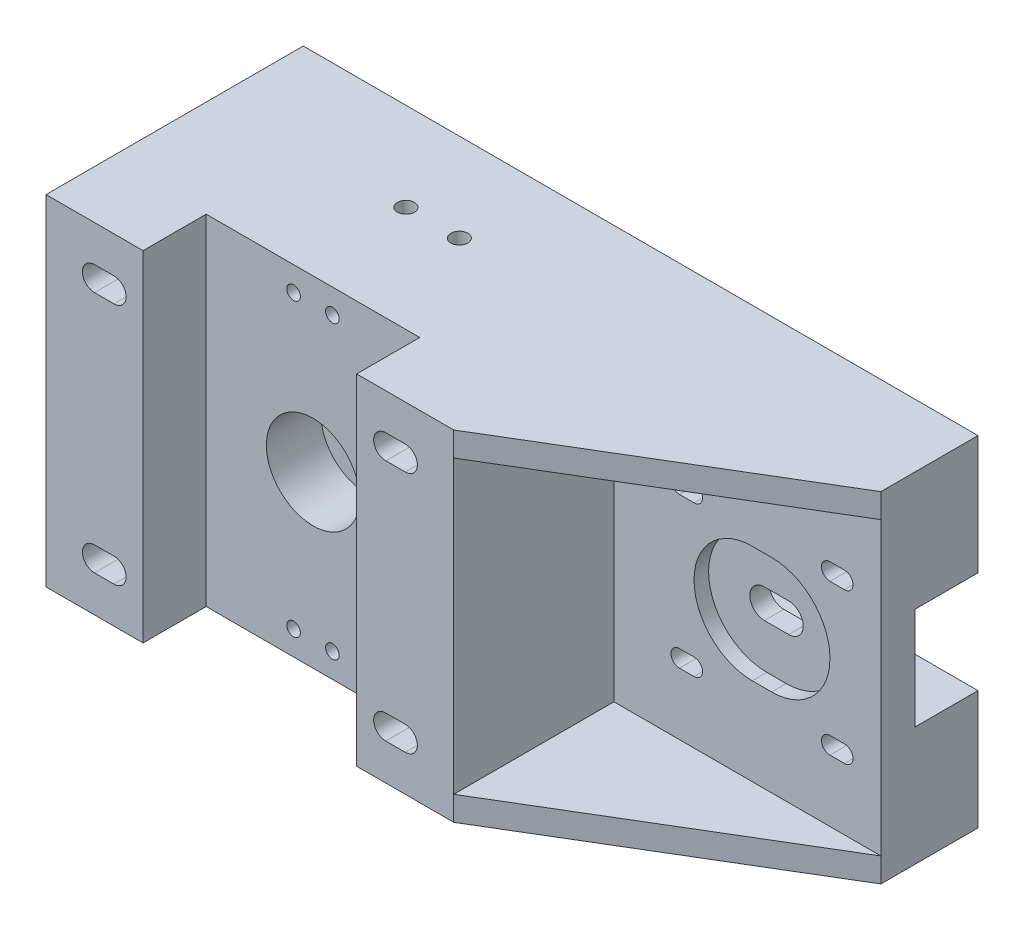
from build123d import *

# Parameters (mm, degrees)
EXTRUDE_1_DEPTH      = 70
SKETCH_2_R           = 1.4
CUT_EXTRUDE_1_DEPTH  = 5
SKETCH_3_R           = 9.6
CUT_EXTRUDE_2_DEPTH  = 11.2
CUT_EXTRUDE_START    = -19
SKETCH_4_R           = 9.6
CUT_EXTRUDE_3_DEPTH  = 19
SKETCH_5_W           = 20
SKETCH_5_H           = 70
EXTRUDE_2_DEPTH      = 55
SKETCH_6_W           = 107
SKETCH_6_H           = 21
CUT_EXTRUDE_4_DEPTH  = 13
EXTRUDE_3_DEPTH      = 5
EXTRUDE_4_DEPTH      = 5
CUT_EXTRUDE_5_DEPTH  = 68
SKETCH_10_R          = 3.25
CUT_EXTRUDE_6_DEPTH  = 68
CUT_EXTRUDE_7_DEPTH  = 3
CUT_EXTRUDE_8_DEPTH  = 125.919974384
CUT_EXTRUDE_10_DEPTH = 5
SKETCH_15_R          = 1.4
CUT_EXTRUDE_11_DEPTH = 5
SKETCH_16_R          = 2.4
CUT_EXTRUDE_12_DEPTH = 131.835774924
SKETCH_17_R          = 1.75
CUT_EXTRUDE_13_DEPTH = 10
CUT_EXTRUDE_14_DEPTH = 25
CUT_EXTRUDE_15_DEPTH = 131.835774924


with BuildPart() as part:
    # Sketch 1 → Extrude 1 (new body)
    with BuildSketch(Plane(origin=(0, 0, 0), x_dir=(1, 0, 0), z_dir=(0, 1, 0))):
        Polygon((-22, 0), (22, 0), (22, -13), (42, -13), (42, 40), (0, 40), (-42, 40), (-42, -13), (-22, -13), align=None)
    extrude(amount=EXTRUDE_1_DEPTH)

    # Sketch 2 → Cut-Extrude 1 (cut)
    with BuildSketch(Plane.XY):
        with Locations((-4, 65)):
            Circle(SKETCH_2_R)
        with Locations(Location((-4, 5, 0), (0, 0, 180))):
            Circle(SKETCH_2_R)
        with Locations((4, 5)):
            Circle(SKETCH_2_R)
        with Locations(Location((4, 65, 0), (0, 0, 180))):
            Circle(SKETCH_2_R)
    extrude(amount=-CUT_EXTRUDE_1_DEPTH, mode=Mode.SUBTRACT)

    # Sketch 3 → Cut-Extrude 2 (cut)
    with BuildSketch(Plane.XY):
        with Locations((0, 35)):
            Circle(SKETCH_3_R)
    extrude(amount=-CUT_EXTRUDE_2_DEPTH, mode=Mode.SUBTRACT)

    # Sketch 4 → Cut-Extrude 3 (cut)
    with BuildSketch(Plane(origin=(0, 0, -40), x_dir=(-1, 0, 0), z_dir=(0, 0, -1)).offset(CUT_EXTRUDE_START)):
        with Locations(Location((0, 35, 0), (0, 0, 180))):
            Circle(SKETCH_4_R)
    extrude(amount=CUT_EXTRUDE_3_DEPTH, mode=Mode.SUBTRACT)

    # Sketch 5 → Extrude 2 (add)
    with BuildSketch(Plane(origin=(42, 0, 0), x_dir=(0, 0, -1), z_dir=(1, 0, 0))):
        with Locations((30, 35)):
            Rectangle(SKETCH_5_W, SKETCH_5_H)
    extrude(amount=EXTRUDE_2_DEPTH)

    # Sketch 6 → Cut-Extrude 4 (cut)
    with BuildSketch(Plane(origin=(0, 0, -40), x_dir=(-1, 0, 0), z_dir=(0, 0, -1))):
        with Locations((-43.5, 35)):
            Rectangle(SKETCH_6_W, SKETCH_6_H)
    extrude(amount=-CUT_EXTRUDE_4_DEPTH, mode=Mode.SUBTRACT)

    # Sketch 7 → Extrude 3 (add)
    with BuildSketch(Plane(origin=(0, 70, 0), x_dir=(1, 0, 0), z_dir=(0, 1, 0))):
        Polygon((42, -13), (97, 20), (42, 20), align=None)
    extrude(amount=-EXTRUDE_3_DEPTH)

    # Sketch 8 → Extrude 4 (add)
    with BuildSketch(Plane.XZ):
        Polygon((42, 13), (97, -20), (42, -20), align=None)
    extrude(amount=-EXTRUDE_4_DEPTH)

    # Sketch 9 → Cut-Extrude 5 (cut)
    with BuildSketch(Plane(origin=(0, 0, -40), x_dir=(-1, 0, 0), z_dir=(0, 0, -1))):
        with BuildLine():
            Line((-89.5, 52.25), (-86.5, 52.25))
            ThreePointArc((-86.5, 52.25), (-84.75, 50.5), (-86.5, 48.75))
            Line((-86.5, 48.75), (-89.5, 48.75))
            ThreePointArc((-89.5, 48.75), (-91.25, 50.5), (-89.5, 52.25))
        make_face()
        with BuildLine():
            Line((-58.5, 52.25), (-55.5, 52.25))
            ThreePointArc((-55.5, 52.25), (-53.75, 50.5), (-55.5, 48.75))
            Line((-55.5, 48.75), (-58.5, 48.75))
            ThreePointArc((-58.5, 48.75), (-60.25, 50.5), (-58.5, 52.25))
        make_face()
        with BuildLine():
            Line((-89.5, 21.25), (-86.5, 21.25))
            ThreePointArc((-86.5, 21.25), (-84.75, 19.5), (-86.5, 17.75))
            Line((-86.5, 17.75), (-89.5, 17.75))
            ThreePointArc((-89.5, 17.75), (-91.25, 19.5), (-89.5, 21.25))
        make_face()
        with BuildLine():
            Line((-58.5, 21.25), (-55.5, 21.25))
            ThreePointArc((-55.5, 21.25), (-53.75, 19.5), (-55.5, 17.75))
            Line((-55.5, 17.75), (-58.5, 17.75))
            ThreePointArc((-58.5, 17.75), (-60.25, 19.5), (-58.5, 21.25))
        make_face()
    extrude(amount=-CUT_EXTRUDE_5_DEPTH, mode=Mode.SUBTRACT)

    # Sketch 10 → Cut-Extrude 6 (cut)
    with BuildSketch(Plane(origin=(0, 0, -21), x_dir=(-1, 0, 0), z_dir=(0, 0, -1))):
        with Locations((0, 35)):
            Circle(SKETCH_10_R)
    extrude(amount=-CUT_EXTRUDE_6_DEPTH, mode=Mode.SUBTRACT)

    # Sketch 11 → Cut-Extrude 7 (cut)
    with BuildSketch(Plane.XY.offset(-20)):
        with BuildLine():
            Line((70.5, 47), (74.5, 47))
            ThreePointArc((74.5, 47), (86.5, 35), (74.5, 23))
            Line((74.5, 23), (70.5, 23))
            ThreePointArc((70.5, 23), (58.5, 35), (70.5, 47))
        make_face()
    extrude(amount=-CUT_EXTRUDE_7_DEPTH, mode=Mode.SUBTRACT)

    # Sketch 12 → Cut-Extrude 8 (cut, through all)
    with BuildSketch(Plane.XY.offset(-23)):
        with BuildLine():
            Line((70, 38), (75, 38))
            ThreePointArc((75, 38), (78, 35), (75, 32))
            Line((75, 32), (70, 32))
            ThreePointArc((70, 32), (67, 35), (70, 38))
        make_face()
    extrude(amount=-CUT_EXTRUDE_8_DEPTH, mode=Mode.SUBTRACT)

    # Sketch 14 → Cut-Extrude 10 (cut)
    with BuildSketch(Plane(origin=(0, 0, -40), x_dir=(-1, 0, 0), z_dir=(0, 0, -1))):
        with BuildLine():
            Line((-90, 53.5), (-86, 53.5))
            ThreePointArc((-86, 53.5), (-83, 50.5), (-86, 47.5))
            Line((-86, 47.5), (-90, 47.5))
            ThreePointArc((-90, 47.5), (-93, 50.5), (-90, 53.5))
        make_face()
        with BuildLine():
            Line((-59, 53.5), (-55, 53.5))
            ThreePointArc((-55, 53.5), (-52, 50.5), (-55, 47.5))
            Line((-55, 47.5), (-59, 47.5))
            ThreePointArc((-59, 47.5), (-62, 50.5), (-59, 53.5))
        make_face()
        with BuildLine():
            Line((-90, 22.5), (-86, 22.5))
            ThreePointArc((-86, 22.5), (-83, 19.5), (-86, 16.5))
            Line((-86, 16.5), (-90, 16.5))
            ThreePointArc((-90, 16.5), (-93, 19.5), (-90, 22.5))
        make_face()
        with BuildLine():
            Line((-59, 22.5), (-55, 22.5))
            ThreePointArc((-55, 22.5), (-52, 19.5), (-55, 16.5))
            Line((-55, 16.5), (-59, 16.5))
            ThreePointArc((-59, 16.5), (-62, 19.5), (-59, 22.5))
        make_face()
    extrude(amount=-CUT_EXTRUDE_10_DEPTH, mode=Mode.SUBTRACT)

    # Sketch 15 → Cut-Extrude 11 (cut)
    with BuildSketch(Plane(origin=(0, 0, -40), x_dir=(-1, 0, 0), z_dir=(0, 0, -1))):
        with Locations((-92, 65)):
            Circle(SKETCH_15_R)
        with Locations((37, 65)):
            Circle(SKETCH_15_R)
        with Locations((37, 5)):
            Circle(SKETCH_15_R)
        with Locations((-92, 5)):
            Circle(SKETCH_15_R)
        with Locations((-13, 65)):
            Circle(SKETCH_15_R)
        with Locations((-13, 5)):
            Circle(SKETCH_15_R)
    extrude(amount=-CUT_EXTRUDE_11_DEPTH, mode=Mode.SUBTRACT)

    # Sketch 16 → Cut-Extrude 12 (cut, through all)
    with BuildSketch(Plane.XY.offset(13)):
        with Locations((-30, 60)):
            Circle(SKETCH_16_R)
        with Locations((30, 60)):
            Circle(SKETCH_16_R)
        with Locations((30, 10)):
            Circle(SKETCH_16_R)
        with Locations((-30, 10)):
            Circle(SKETCH_16_R)
    extrude(amount=-CUT_EXTRUDE_12_DEPTH, mode=Mode.SUBTRACT)

    # Sketch 17 → Cut-Extrude 13 (cut)
    with BuildSketch(Plane(origin=(0, 70, 0), x_dir=(1, 0, 0), z_dir=(0, 1, 0))):
        with Locations(Location((8.35, 21.8, 0), (0, 0, 270))):
            Circle(SKETCH_17_R)
        with Locations(Location((-2.65, 21.8, 0), (0, 0, 270))):
            Circle(SKETCH_17_R)
    extrude(amount=-CUT_EXTRUDE_13_DEPTH, mode=Mode.SUBTRACT)

    # Sketch 18 → Cut-Extrude 14 (cut)
    with BuildSketch(Plane(origin=(0, 0, -40), x_dir=(-1, 0, 0), z_dir=(0, 0, -1))):
        with BuildLine():
            Line((-33, 64), (-27, 64))
            ThreePointArc((-27, 64), (-23, 60), (-27, 56))
            Line((-27, 56), (-33, 56))
            ThreePointArc((-33, 56), (-37, 60), (-33, 64))
        make_face()
        with BuildLine():
            Line((27, 64), (33, 64))
            ThreePointArc((33, 64), (37, 60), (33, 56))
            Line((33, 56), (27, 56))
            ThreePointArc((27, 56), (23, 60), (27, 64))
        make_face()
        with BuildLine():
            Line((27, 6), (33, 6))
            ThreePointArc((33, 6), (37, 10), (33, 14))
            Line((33, 14), (27, 14))
            ThreePointArc((27, 14), (23, 10), (27, 6))
        make_face()
        with BuildLine():
            Line((-33, 6), (-27, 6))
            ThreePointArc((-27, 6), (-23, 10), (-27, 14))
            Line((-27, 14), (-33, 14))
            ThreePointArc((-33, 14), (-37, 10), (-33, 6))
        make_face()
    extrude(amount=-CUT_EXTRUDE_14_DEPTH, mode=Mode.SUBTRACT)

    # Sketch 19 → Cut-Extrude 15 (cut, through all)
    with BuildSketch(Plane.XY.offset(13)):
        with BuildLine():
            Line((-32, 62.5), (-28, 62.5))
            ThreePointArc((-28, 62.5), (-25.5, 60), (-28, 57.5))
            Line((-28, 57.5), (-32, 57.5))
            ThreePointArc((-32, 57.5), (-34.5, 60), (-32, 62.5))
        make_face()
        with BuildLine():
            Line((28, 62.5), (32, 62.5))
            ThreePointArc((32, 62.5), (34.5, 60), (32, 57.5))
            Line((32, 57.5), (28, 57.5))
            ThreePointArc((28, 57.5), (25.5, 60), (28, 62.5))
        make_face()
        with BuildLine():
            Line((28, 7.5), (32, 7.5))
            ThreePointArc((32, 7.5), (34.5, 10), (32, 12.5))
            Line((32, 12.5), (28, 12.5))
            ThreePointArc((28, 12.5), (25.5, 10), (28, 7.5))
        make_face()
        with BuildLine():
            Line((-32, 7.5), (-28, 7.5))
            ThreePointArc((-28, 7.5), (-25.5, 10), (-28, 12.5))
            Line((-28, 12.5), (-32, 12.5))
            ThreePointArc((-32, 12.5), (-34.5, 10), (-32, 7.5))
        make_face()
    extrude(amount=-CUT_EXTRUDE_15_DEPTH, mode=Mode.SUBTRACT)


solid = part.part
